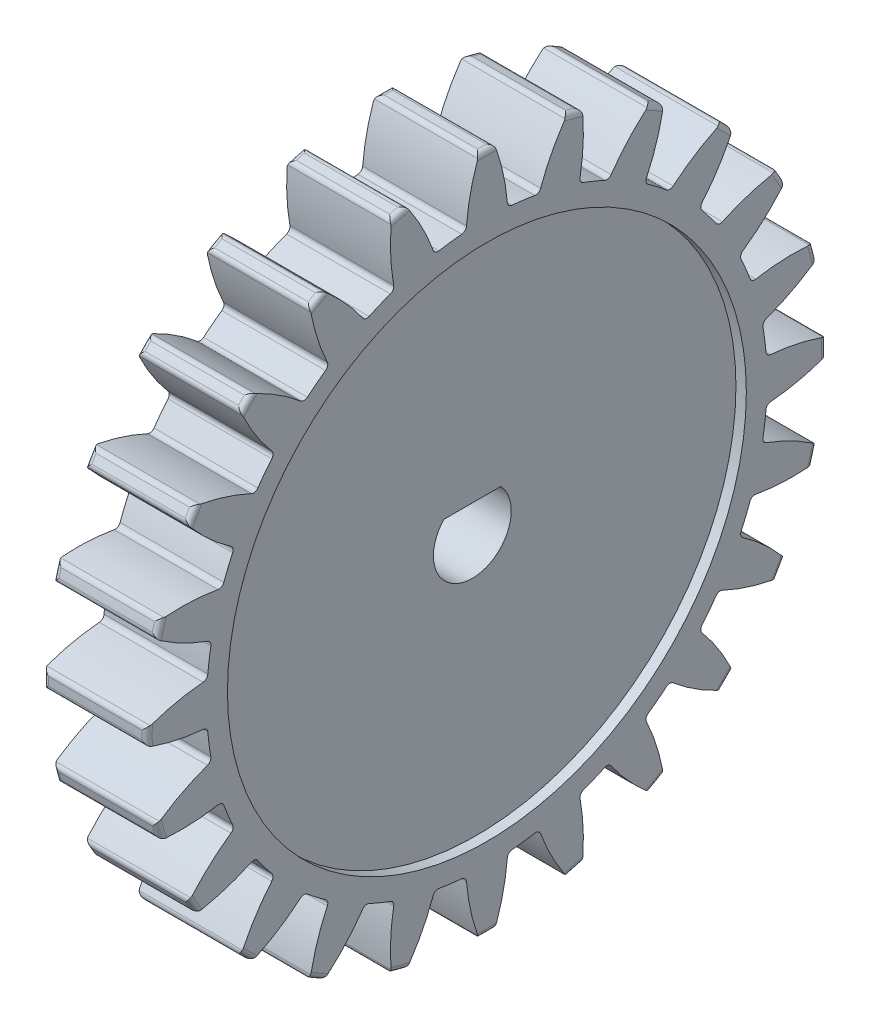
from build123d import *

# Parameters (mm, degrees)
CROQUIS1_R                    = 10.8
BODY_DEPTH                    = 2
CORTAR_EXTRUIR1_START         = 1.6
CROQUIS2_R                    = 10
CORTAR_EXTRUIR1_DEPTH         = 0.8
TOOTH_DEPTH                   = 2
REDONDEO1_R                   = 0.2
MATRIZC1_TEETH_COUNT          = 24
REDONDEO1_OF_MATRIZC1_TEETH_R = 0.2
CUT_EXTRUDE7_DEPTH            = 10


with BuildPart() as part:
    # Croquis1 → Body (new, symmetric)
    with BuildSketch(Plane(origin=(0, 0, 0), x_dir=(0, 0, -1), z_dir=(1, 0, 0))):
        Circle(CROQUIS1_R)
    extrude(amount=BODY_DEPTH, both=True)

    # Croquis2 → Cortar-Extruir1 (cut)
    with BuildSketch(Plane(origin=(0, 0, 0), x_dir=(0, 0, -1), z_dir=(1, 0, 0)).offset(CORTAR_EXTRUIR1_START)):
        Circle(CROQUIS2_R)
    cortar_extruir1 = extrude(amount=CORTAR_EXTRUIR1_DEPTH, mode=Mode.SUBTRACT)

    # Simetr_a1: Cortar-Extruir1 across plane
    add(cortar_extruir1.mirror(Plane(origin=(0, 0, 0), x_dir=(0, 0, 1), z_dir=(1, 0, 0))), mode=Mode.SUBTRACT)

    # Croquis7 → Tooth (add, symmetric)
    with BuildSketch(Plane(origin=(0, 0, 0), x_dir=(0, 0, -1), z_dir=(1, 0, 0))):
        with BuildLine():
            ThreePointArc((0.3, 13.096564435), (0, 13.1), (-0.3, 13.096564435))
            ThreePointArc((-0.3, 13.096564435), (-0.636967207, 11.952139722), (-0.8, 10.770329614))
            ThreePointArc((-0.8, 10.770329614), (0, 10.8), (0.8, 10.770329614))
            ThreePointArc((0.8, 10.770329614), (0.636967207, 11.952139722), (0.3, 13.096564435))
        make_face()
    tooth = extrude(amount=TOOTH_DEPTH, both=True)

    # Redondeo1
    redondeo1_edges = [part.edges().sort_by_distance(p)[0] for p in [
        (0, 13.096564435, 0.3),
        (0, 10.770329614, 0.8),
        (0, 10.770329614, -0.8),
        (-2, 13.1, 0),
        (0, 13.096564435, -0.3),
        (2, 13.1, 0),
    ]]
    fillet(redondeo1_edges, radius=REDONDEO1_R)

    # MatrizC1 Teeth: Tooth ×24 about axis
    matrizc1_teeth_axis = Axis((0, 0, 0), (1, 0, 0))
    for i in range(1, MATRIZC1_TEETH_COUNT):
        add(tooth.rotate(matrizc1_teeth_axis, i * 360 / MATRIZC1_TEETH_COUNT))

    # Redondeo1 of MatrizC1 Teeth
    redondeo1_of_matrizc1_teeth_edges = [part.edges().sort_by_distance(p)[0] for p in [
        (0, 12.57266411, 3.679418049),
        (0, 10.196284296, 3.560307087),
        (0, 10.610394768, 2.014825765),
        (-2, 12.653628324, 3.390529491),
        (0, 12.727955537, 3.099862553),
        (2, 12.653628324, 3.390529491),
        (0, 11.191957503, 6.808089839),
        (0, 8.927379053, 6.07798513),
        (0, 9.727379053, 4.692344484),
        (-2, 11.34493279, 6.55),
        (0, 11.491957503, 6.288474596),
        (2, 11.34493279, 6.55),
        (0, 9.048537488, 9.472801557),
        (0, 7.050087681, 8.181458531),
        (0, 8.181458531, 7.050087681),
        (-2, 9.263098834, 9.263098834),
        (0, 9.472801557, 9.048537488),
        (2, 9.263098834, 9.263098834),
        (0, 6.288474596, 11.491957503),
        (0, 4.692344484, 9.727379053),
        (0, 6.07798513, 8.927379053),
        (-2, 6.55, 11.34493279),
        (0, 6.808089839, 11.191957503),
        (2, 6.55, 11.34493279),
        (0, 3.099862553, 12.727955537),
        (0, 2.014825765, 10.610394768),
        (0, 3.560307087, 10.196284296),
        (-2, 3.390529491, 12.653628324),
        (0, 3.679418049, 12.57266411),
        (2, 3.390529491, 12.653628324),
        (0, -0.3, 13.096564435),
        (0, -0.8, 10.770329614),
        (0, 0.8, 10.770329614),
        (-2, 0, 13.1),
        (0, 0.3, 13.096564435),
        (2, 0, 13.1),
        (0, -3.679418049, 12.57266411),
        (0, -3.560307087, 10.196284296),
        (0, -2.014825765, 10.610394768),
        (-2, -3.390529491, 12.653628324),
        (0, -3.099862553, 12.727955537),
        (2, -3.390529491, 12.653628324),
        (0, -6.808089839, 11.191957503),
        (0, -6.07798513, 8.927379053),
        (0, -4.692344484, 9.727379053),
        (-2, -6.55, 11.34493279),
        (0, -6.288474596, 11.491957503),
        (2, -6.55, 11.34493279),
        (0, -9.472801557, 9.048537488),
        (0, -8.181458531, 7.050087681),
        (0, -7.050087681, 8.181458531),
        (-2, -9.263098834, 9.263098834),
        (0, -9.048537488, 9.472801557),
        (2, -9.263098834, 9.263098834),
        (0, -11.491957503, 6.288474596),
        (0, -9.727379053, 4.692344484),
        (0, -8.927379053, 6.07798513),
        (-2, -11.34493279, 6.55),
        (0, -11.191957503, 6.808089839),
        (2, -11.34493279, 6.55),
        (0, -12.727955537, 3.099862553),
        (0, -10.610394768, 2.014825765),
        (0, -10.196284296, 3.560307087),
        (-2, -12.653628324, 3.390529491),
        (0, -12.57266411, 3.679418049),
        (2, -12.653628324, 3.390529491),
        (0, -13.096564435, -0.3),
        (0, -10.770329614, -0.8),
        (0, -10.770329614, 0.8),
        (-2, -13.1, 0),
        (0, -13.096564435, 0.3),
        (2, -13.1, 0),
        (0, -12.57266411, -3.679418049),
        (0, -10.196284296, -3.560307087),
        (0, -10.610394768, -2.014825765),
        (-2, -12.653628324, -3.390529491),
        (0, -12.727955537, -3.099862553),
        (2, -12.653628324, -3.390529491),
        (0, -11.191957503, -6.808089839),
        (0, -8.927379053, -6.07798513),
        (0, -9.727379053, -4.692344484),
        (-2, -11.34493279, -6.55),
        (0, -11.491957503, -6.288474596),
        (2, -11.34493279, -6.55),
        (0, -9.048537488, -9.472801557),
        (0, -7.050087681, -8.181458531),
        (0, -8.181458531, -7.050087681),
        (-2, -9.263098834, -9.263098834),
        (0, -9.472801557, -9.048537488),
        (2, -9.263098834, -9.263098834),
        (0, -6.288474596, -11.491957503),
        (0, -4.692344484, -9.727379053),
        (0, -6.07798513, -8.927379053),
        (-2, -6.55, -11.34493279),
        (0, -6.808089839, -11.191957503),
        (2, -6.55, -11.34493279),
        (0, -3.099862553, -12.727955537),
        (0, -2.014825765, -10.610394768),
        (0, -3.560307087, -10.196284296),
        (-2, -3.390529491, -12.653628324),
        (0, -3.679418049, -12.57266411),
        (2, -3.390529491, -12.653628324),
        (0, 0.3, -13.096564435),
        (0, 0.8, -10.770329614),
        (0, -0.8, -10.770329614),
        (-2, 0, -13.1),
        (0, -0.3, -13.096564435),
        (2, 0, -13.1),
        (0, 3.679418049, -12.57266411),
        (0, 3.560307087, -10.196284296),
        (0, 2.014825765, -10.610394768),
        (-2, 3.390529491, -12.653628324),
        (0, 3.099862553, -12.727955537),
        (2, 3.390529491, -12.653628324),
        (0, 6.808089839, -11.191957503),
        (0, 6.07798513, -8.927379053),
        (0, 4.692344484, -9.727379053),
        (-2, 6.55, -11.34493279),
        (0, 6.288474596, -11.491957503),
        (2, 6.55, -11.34493279),
        (0, 9.472801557, -9.048537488),
        (0, 8.181458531, -7.050087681),
        (0, 7.050087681, -8.181458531),
        (-2, 9.263098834, -9.263098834),
        (0, 9.048537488, -9.472801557),
        (2, 9.263098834, -9.263098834),
        (0, 11.491957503, -6.288474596),
        (0, 9.727379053, -4.692344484),
        (0, 8.927379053, -6.07798513),
        (-2, 11.34493279, -6.55),
        (0, 11.191957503, -6.808089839),
        (2, 11.34493279, -6.55),
        (0, 12.727955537, -3.099862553),
        (0, 10.610394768, -2.014825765),
        (0, 10.196284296, -3.560307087),
        (-2, 12.653628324, -3.390529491),
        (0, 12.57266411, -3.679418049),
        (2, 12.653628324, -3.390529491),
    ]]
    fillet(redondeo1_of_matrizc1_teeth_edges, radius=REDONDEO1_OF_MATRIZC1_TEETH_R)

    # Sketch2 → Cut-Extrude7 (cut)
    with BuildSketch(Plane(origin=(1.6, 0, 0), x_dir=(0, 0, -1), z_dir=(1, 0, 0))):
        with BuildLine():
            Line((-1.264470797, 1.182942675), (0.939518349, 1.184189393))
            ThreePointArc((0.939518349, 1.184189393), (-0.16105208, -1.334081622), (-1.264470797, 1.182942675))
        make_face()
    extrude(amount=-CUT_EXTRUDE7_DEPTH, mode=Mode.SUBTRACT)


solid = part.part
